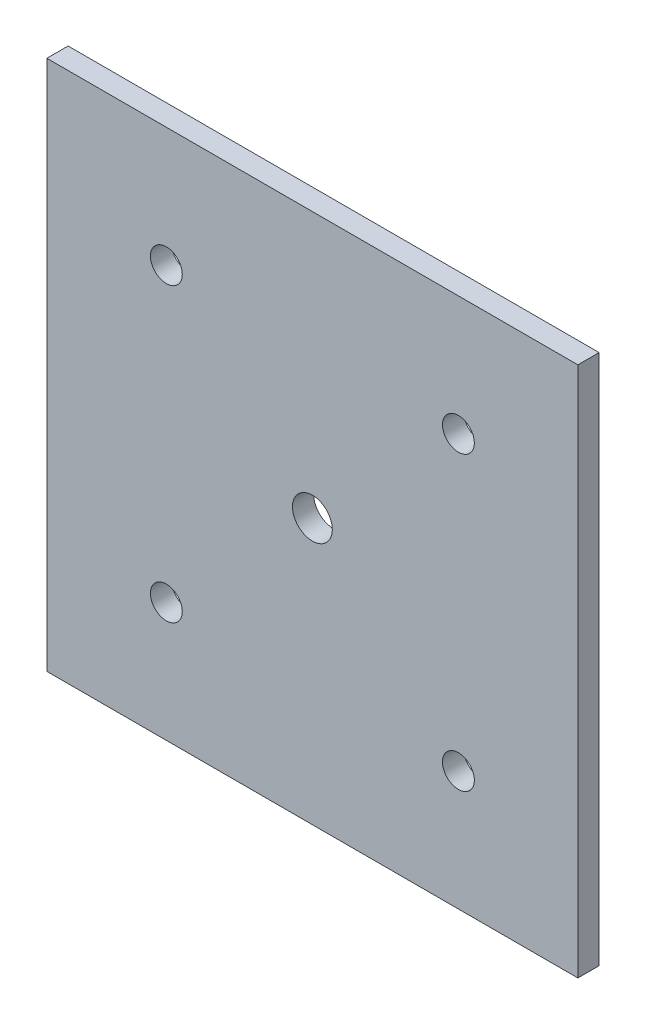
from build123d import *

# Parameters (mm, degrees)
SKETCH1_W           = 200
SKETCH1_H           = 200
BOSS_EXTRUDE1_DEPTH = 8
SKETCH2_R           = 6
CUT_EXTRUDE1_DEPTH  = 142.647449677
SKETCH3_R           = 7.5
CUT_EXTRUDE2_DEPTH  = 142.647449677


with BuildPart() as part:
    # Sketch1 → Boss-Extrude1 (new body)
    with BuildSketch(Plane(origin=(0, 0, 0), x_dir=(0, 1, 0), z_dir=(0, 0, 1))):
        Rectangle(SKETCH1_W, SKETCH1_H)
    extrude(amount=BOSS_EXTRUDE1_DEPTH)

    # Sketch2 → Cut-Extrude1 (cut, through all)
    with BuildSketch(Plane(origin=(0, 0, 0), x_dir=(0, 1, 0), z_dir=(0, 0, 1))):
        with Locations(Location((-55, 55, 0), (0, 0, 270))):
            Circle(SKETCH2_R)
        with Locations(Location((55, 55, 0), (0, 0, 270))):
            Circle(SKETCH2_R)
        with Locations(Location((-55, -55, 0), (0, 0, 270))):
            Circle(SKETCH2_R)
        with Locations(Location((55, -55, 0), (0, 0, 270))):
            Circle(SKETCH2_R)
    extrude(amount=CUT_EXTRUDE1_DEPTH, mode=Mode.SUBTRACT)

    # Sketch3 → Cut-Extrude2 (cut, through all)
    with BuildSketch(Plane(origin=(0, 0, 0), x_dir=(0, 1, 0), z_dir=(0, 0, 1))):
        with Locations(Location((0, 0, 0), (0, 0, 270))):
            Circle(SKETCH3_R)
    extrude(amount=CUT_EXTRUDE2_DEPTH, mode=Mode.SUBTRACT)


solid = part.part
